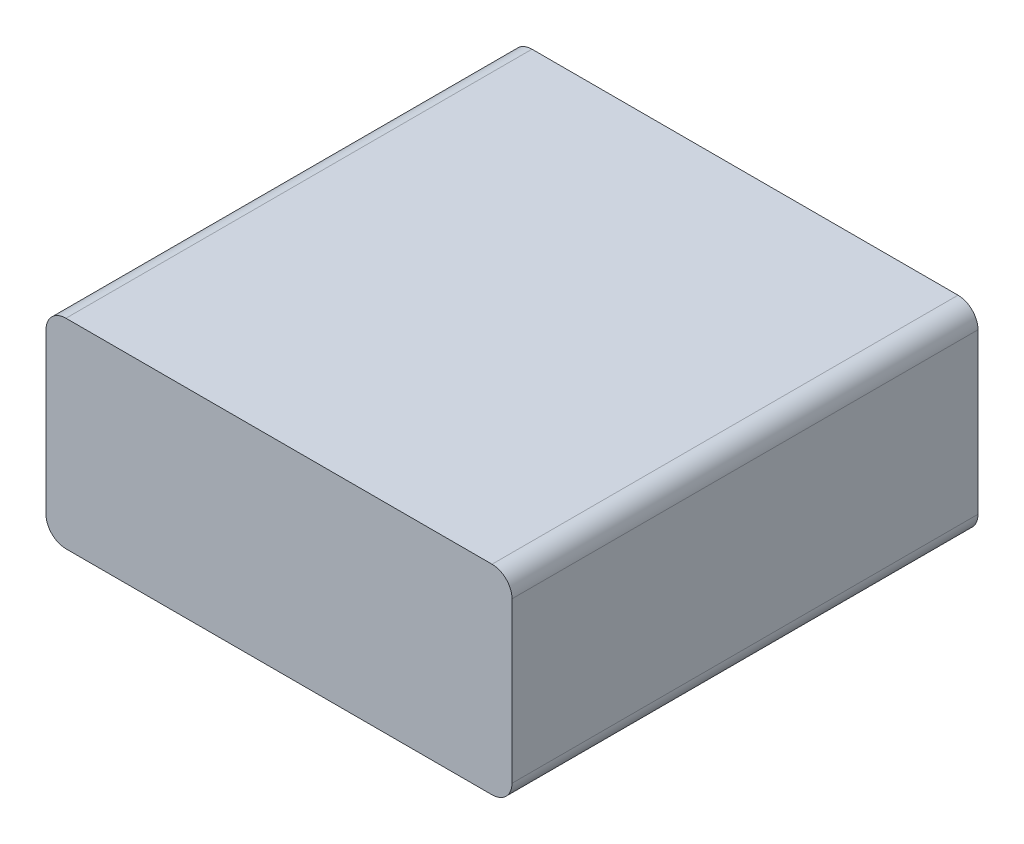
from build123d import *

# Parameters (mm, degrees)
SKETCH1_W           = 88.9
SKETCH1_H           = 88.9
BOSS_EXTRUDE1_DEPTH = 38.1
FILLET1_R           = 3.81


with BuildPart() as part:
    # Sketch1 → Boss-Extrude1 (new body)
    with BuildSketch(Plane(origin=(0, 0, 0), x_dir=(1, 0, 0), z_dir=(0, 1, 0))):
        with Locations((1.225102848, 0)):
            Rectangle(SKETCH1_W, SKETCH1_H)
    extrude(amount=BOSS_EXTRUDE1_DEPTH)

    # Fillet1
    fillet1_edges = [part.edges().sort_by_distance(p)[0] for p in [
        (45.675102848, 38.1, 0),
        (-43.224897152, 38.1, 0),
        (45.675102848, 0, 0),
        (-43.224897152, 0, 0),
    ]]
    fillet(fillet1_edges, radius=FILLET1_R)


solid = part.part
